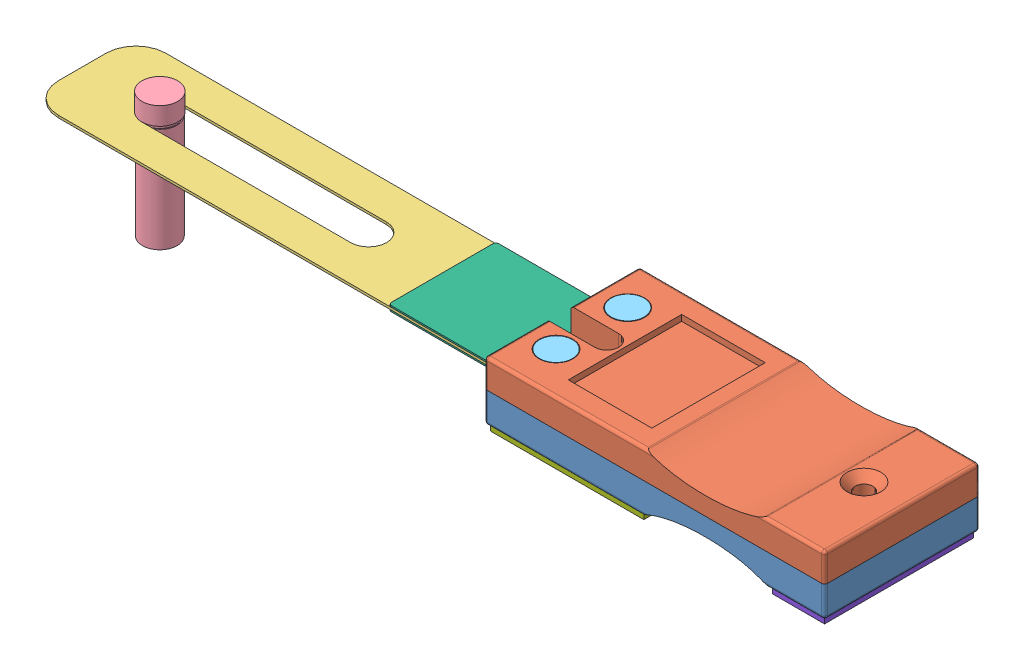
SolidWorks assembly see Mechanism together.SLDASM, configuration Default (file format 7000). Lengths in mm.
Overall size (137.4 22.78 26).
10 component instances, 8 part files, 22 mates.
Components (placement in the parent):
- Bottom Plate-2: Bottom Plate.SLDPRT [Default] at (1.9847 25 -2.4146) size (57 5.15 26)
- TOP PLATE-5: TOP PLATE.SLDPRT [Default] at (0.9799 34.9 9.992) x (1 0 0) z (0 0 -1) size (57 5.25 26)
- Pizo Plate-3: Pizo Plate.SLDPRT [Default] at (-32.7518 29.74 -6.216) size (90.4 0.4 18)
- screw tip-1: screw tip.SLDPRT [Default] at (-110.1518 29.74 2.784) x (-0.375983 0 0.926627) z (0 -1 0) size (6 6 21)
- screw sample(mock)-11: screw sample(mock).SLDPRT [Default] at (-39.0733 31.5242 -2.754) x (0.94399 0 -0.329973) z (0 -1 0) size (5.5 5.5 9.9)
- screw sample(mock)-12: screw sample(mock).SLDPRT [Default] at (-39.1487 31.4896 8.6917) x (0.997825 0 0.065921) z (0 -1 0) size (5.5 5.5 9.9)
- Pizo mini-7: Pizo mini.SLDPRT [Default] at (-50.6127 29.486 -1.079) size (20 0.25 18)
- Pizo mini-8: Pizo mini.SLDPRT [Default] at (-50.6102 30.14 -1.079) size (20 0.25 18)
- magnetic mat-1: magnetic mat.SLDPRT [Default] at (-29.2734 24 -0.6263) size (25.7 1 25)
- magnetic mat small-1: magnetic mat small.SLDPRT [Default] at (18.0146 24 -0.6263) size (8.7 1 25)
Mates (geometry in assembly coordinates):
- Coincident71: coincident anti-aligned: plane of Bottom Plate-2 through (1.9847 30.15 -2.4146) normal (0 1 0); plane of TOP PLATE-5 through (0.9799 30.15 9.992) normal (0 -1 0)
- Concentric2: concentric aligned: cylinder of Bottom Plate-2 through (7.3482 30.15 2.284) axis (0 1 0) radius 0.95; cylinder of TOP PLATE-5 through (7.3482 34.9 2.284) axis (0 1 0) radius 1.5
- Coincident72: coincident anti-aligned: line of Bottom Plate-2 through (13.7482 30.15 -10.216) axis (-1 0 0); line of TOP PLATE-5 through (-42.2518 30.15 -10.216) axis (1 0 0)
- Concentric3: concentric aligned: cylinder of TOP PLATE-5 through (-37.7518 34.9 -3.216) axis (0 1 0) radius 1.5; circle of Pizo Plate-3
- Concentric4: concentric aligned: cylinder of TOP PLATE-5 through (-37.7518 34.9 8.784) axis (0 1 0) radius 1.5; circle of Pizo Plate-3
- Coincident88: coincident aligned: circle of Pizo Plate-3; circle of screw tip-1
- Lock4: lock: unknown of Pizo Plate-3; unknown of screw tip-1
- Coincident89: coincident anti-aligned: plane of Bottom Plate-2 through (1.9847 29.74 -2.4146) normal (0 1 0); plane of Pizo Plate-3 through (-32.7518 29.74 -6.216) normal (0 -1 0)
- Concentric6: concentric aligned: cylinder of TOP PLATE-5 through (-37.7518 34.9 8.784) axis (0 1 0) radius 1.5; cylinder of screw sample(mock)-12 through (-37.7518 24.9896 8.784) axis (0 1 0) radius 1.5
- Concentric7: concentric aligned: cylinder of TOP PLATE-5 through (-37.7518 34.9 -3.216) axis (0 1 0) radius 1.5; cylinder of screw sample(mock)-11 through (-37.7518 25.0242 -3.216) axis (0 1 0) radius 1.5
- Lock5: lock: unknown of TOP PLATE-5; unknown of screw sample(mock)-12
- Lock6: lock: unknown of TOP PLATE-5; unknown of screw sample(mock)-11
- Coincident92: coincident aligned: line of Pizo Plate-3 through (-118.1518 30.14 11.784) axis (1 0 0); line of Pizo mini-8 through (-62.3362 30.14 11.784) axis (1 0 0)
- Coincident93: coincident aligned: line of Pizo Plate-3 through (-118.1518 29.74 11.784) axis (1 0 0); line of Pizo mini-7 through (-62.3387 29.74 11.784) axis (1 0 0)
- Coincident94: coincident aligned: line of Pizo Plate-3 through (-37.7518 29.74 -6.216) axis (-1 0 0); line of Pizo mini-7 through (-43.3387 29.74 -6.216) axis (-1 0 0)
- Coincident96: coincident aligned: line of Pizo Plate-3 through (-37.7518 30.14 -6.216) axis (-1 0 0); line of Pizo mini-8 through (-43.3362 30.14 -6.216) axis (-1 0 0)
- Lock8: lock: unknown of Pizo Plate-3; unknown of Pizo mini-7
- Lock9: lock: unknown of Pizo Plate-3; unknown of Pizo mini-8
- Coincident97: coincident anti-aligned: line of Bottom Plate-2 through (-16.5457 25 15.284) axis (-1 0 0); line of magnetic mat-1 through (-42.2457 25 15.284) axis (1 0 0)
- Coincident98: coincident anti-aligned: line of Bottom Plate-2 through (-16.5457 25 -9.716) axis (0 0 1); line of magnetic mat-1 through (-16.5457 25 15.284) axis (0 0 -1)
- Coincident99: coincident anti-aligned: line of Bottom Plate-2 through (5.0422 25 15.284) axis (0 0 -1); line of magnetic mat small-1 through (5.0422 25 -9.716) axis (0 0 1)
- Coincident100: coincident anti-aligned: line of Bottom Plate-2 through (5.0422 25 -9.716) axis (1 0 0); line of magnetic mat small-1 through (13.7422 25 -9.716) axis (-1 0 0)
